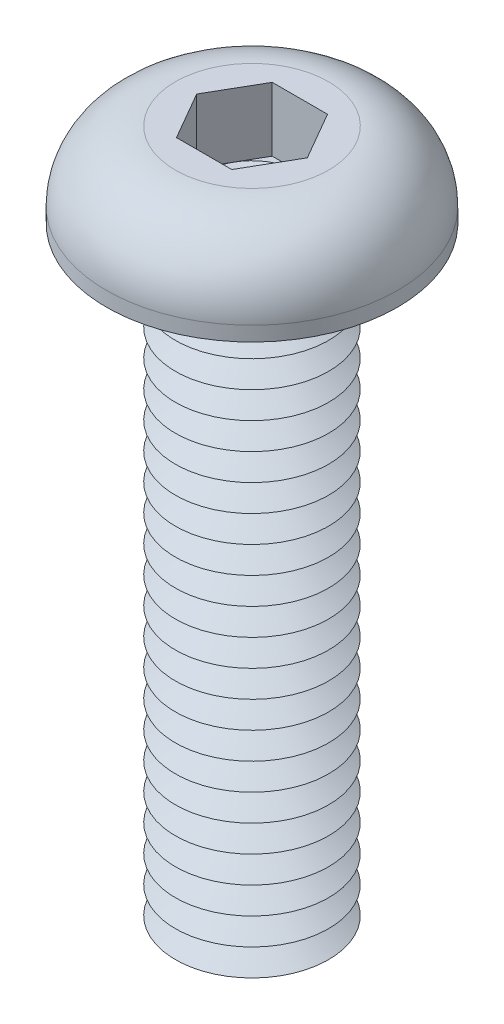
ISO-10303-21;
HEADER;
FILE_DESCRIPTION(('STEP AP214'),'2;1');
FILE_NAME('part.step','',(''),(''),'','','');
FILE_SCHEMA(('AUTOMOTIVE_DESIGN { 1 0 10303 214 1 1 1 1 }'));
ENDSEC;
DATA;
#1=APPLICATION_CONTEXT('core data for automotive mechanical design processes');
#2=APPLICATION_PROTOCOL_DEFINITION('international standard','automotive_design',2000,#1);
#3=PRODUCT_CONTEXT('',#1,'mechanical');
#4=PRODUCT('Part','Part','',(#3));
#5=PRODUCT_RELATED_PRODUCT_CATEGORY('part','',(#4));
#6=PRODUCT_DEFINITION_FORMATION('','',#4);
#7=PRODUCT_DEFINITION_CONTEXT('part definition',#1,'design');
#8=PRODUCT_DEFINITION('design','',#6,#7);
#9=PRODUCT_DEFINITION_SHAPE('','',#8);
#10=(LENGTH_UNIT() NAMED_UNIT(*) SI_UNIT(.MILLI.,.METRE.));
#11=(NAMED_UNIT(*) PLANE_ANGLE_UNIT() SI_UNIT($,.RADIAN.));
#12=(NAMED_UNIT(*) SI_UNIT($,.STERADIAN.) SOLID_ANGLE_UNIT());
#13=UNCERTAINTY_MEASURE_WITH_UNIT(LENGTH_MEASURE(1.E-05),#10,'distance_accuracy_value','');
#14=(GEOMETRIC_REPRESENTATION_CONTEXT(3) GLOBAL_UNCERTAINTY_ASSIGNED_CONTEXT((#13)) GLOBAL_UNIT_ASSIGNED_CONTEXT((#10,
#11,#12)) REPRESENTATION_CONTEXT('',''));
#15=CARTESIAN_POINT('',(0.,0.,0.));
#16=DIRECTION('',(0.,0.,1.));
#17=DIRECTION('',(1.,0.,0.));
#18=AXIS2_PLACEMENT_3D('',#15,#16,#17);
#19=CARTESIAN_POINT('',(0.,0.,0.));
#20=DIRECTION('',(0.,-1.,0.));
#21=DIRECTION('',(0.,0.,-1.));
#22=AXIS2_PLACEMENT_3D('',#19,#20,#21);
#23=TOROIDAL_SURFACE('',#22,2.35,0.35);
#24=CARTESIAN_POINT('',(0.,0.,-2.7));
#25=VERTEX_POINT('',#24);
#26=VERTEX_LOOP('',#25);
#27=FACE_BOUND('',#26,.T.);
#28=ADVANCED_FACE('P0_F12',(#27),#23,.T.);
#29=CLOSED_SHELL('',(#28));
#30=MANIFOLD_SOLID_BREP('P0_B1',#29);
#31=CARTESIAN_POINT('',(0.721687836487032,0.530000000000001,-1.25));
#32=DIRECTION('',(0.,1.,0.));
#33=DIRECTION('',(0.,0.,1.));
#34=AXIS2_PLACEMENT_3D('',#31,#32,#33);
#35=PLANE('',#34);
#36=CARTESIAN_POINT('',(0.,0.530000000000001,0.));
#37=DIRECTION('',(0.,1.,0.));
#38=DIRECTION('',(0.,0.,1.));
#39=AXIS2_PLACEMENT_3D('',#36,#37,#38);
#40=CIRCLE('',#39,1.25);
#41=CARTESIAN_POINT('',(0.,0.530000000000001,1.25));
#42=VERTEX_POINT('',#41);
#43=CARTESIAN_POINT('',(1.08253175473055,0.530000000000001,0.625));
#44=VERTEX_POINT('',#43);
#45=EDGE_CURVE('P1_E93',#42,#44,#40,.T.);
#46=ORIENTED_EDGE('',*,*,#45,.F.);
#47=DIRECTION('',(1.,0.,0.));
#48=VECTOR('',#47,1.);
#49=CARTESIAN_POINT('',(-0.721687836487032,0.530000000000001,1.25));
#50=LINE('',#49,#48);
#51=CARTESIAN_POINT('',(0.721687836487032,0.530000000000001,1.25));
#52=VERTEX_POINT('',#51);
#53=EDGE_CURVE('P1_E116',#42,#52,#50,.T.);
#54=ORIENTED_EDGE('',*,*,#53,.T.);
#55=DIRECTION('',(0.5,0.,-0.866025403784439));
#56=VECTOR('',#55,1.);
#57=CARTESIAN_POINT('',(0.721687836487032,0.530000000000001,1.25));
#58=LINE('',#57,#56);
#59=EDGE_CURVE('P1_E112',#52,#44,#58,.T.);
#60=ORIENTED_EDGE('',*,*,#59,.T.);
#61=EDGE_LOOP('',(#46,#54,#60));
#62=FACE_BOUND('',#61,.T.);
#63=ADVANCED_FACE('P1_F15',(#62),#35,.T.);
#64=CARTESIAN_POINT('',(0.,0.530000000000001,0.));
#65=DIRECTION('',(0.,1.,0.));
#66=DIRECTION('',(0.,0.,1.));
#67=AXIS2_PLACEMENT_3D('',#64,#65,#66);
#68=CIRCLE('',#67,1.25);
#69=CARTESIAN_POINT('',(1.08253175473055,0.530000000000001,-0.625));
#70=VERTEX_POINT('',#69);
#71=EDGE_CURVE('P1_E10',#44,#70,#68,.T.);
#72=ORIENTED_EDGE('',*,*,#71,.F.);
#73=CARTESIAN_POINT('',(1.44337567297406,0.530000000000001,0.));
#74=VERTEX_POINT('',#73);
#75=EDGE_CURVE('P1_E104',#44,#74,#58,.T.);
#76=ORIENTED_EDGE('',*,*,#75,.T.);
#77=DIRECTION('',(-0.5,0.,-0.866025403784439));
#78=VECTOR('',#77,1.);
#79=CARTESIAN_POINT('',(1.44337567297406,0.530000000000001,0.));
#80=LINE('',#79,#78);
#81=EDGE_CURVE('P1_E107',#74,#70,#80,.T.);
#82=ORIENTED_EDGE('',*,*,#81,.T.);
#83=EDGE_LOOP('',(#72,#76,#82));
#84=FACE_BOUND('',#83,.T.);
#85=ADVANCED_FACE('P1_F103',(#84),#35,.T.);
#86=CARTESIAN_POINT('',(0.,0.530000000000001,-1.25));
#87=VERTEX_POINT('',#86);
#88=EDGE_CURVE('P1_E24',#70,#87,#68,.T.);
#89=ORIENTED_EDGE('',*,*,#88,.F.);
#90=CARTESIAN_POINT('',(0.721687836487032,0.530000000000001,-1.25));
#91=VERTEX_POINT('',#90);
#92=EDGE_CURVE('P1_E139',#70,#91,#80,.T.);
#93=ORIENTED_EDGE('',*,*,#92,.T.);
#94=DIRECTION('',(-1.,0.,0.));
#95=VECTOR('',#94,1.);
#96=CARTESIAN_POINT('',(0.721687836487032,0.530000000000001,-1.25));
#97=LINE('',#96,#95);
#98=EDGE_CURVE('P1_E354',#91,#87,#97,.T.);
#99=ORIENTED_EDGE('',*,*,#98,.T.);
#100=EDGE_LOOP('',(#89,#93,#99));
#101=FACE_BOUND('',#100,.T.);
#102=ADVANCED_FACE('P1_F319',(#101),#35,.T.);
#103=CARTESIAN_POINT('',(-1.08253175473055,0.530000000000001,-0.625));
#104=VERTEX_POINT('',#103);
#105=EDGE_CURVE('P1_E349',#87,#104,#68,.T.);
#106=ORIENTED_EDGE('',*,*,#105,.F.);
#107=CARTESIAN_POINT('',(-0.721687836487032,0.530000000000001,-1.25));
#108=VERTEX_POINT('',#107);
#109=EDGE_CURVE('P1_E358',#87,#108,#97,.T.);
#110=ORIENTED_EDGE('',*,*,#109,.T.);
#111=DIRECTION('',(-0.5,0.,0.866025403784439));
#112=VECTOR('',#111,1.);
#113=CARTESIAN_POINT('',(-0.721687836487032,0.530000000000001,-1.25));
#114=LINE('',#113,#112);
#115=EDGE_CURVE('P1_E353',#108,#104,#114,.T.);
#116=ORIENTED_EDGE('',*,*,#115,.T.);
#117=EDGE_LOOP('',(#106,#110,#116));
#118=FACE_BOUND('',#117,.T.);
#119=ADVANCED_FACE('P1_F333',(#118),#35,.T.);
#120=CARTESIAN_POINT('',(-1.08253175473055,0.530000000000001,0.625));
#121=VERTEX_POINT('',#120);
#122=EDGE_CURVE('P1_E31',#104,#121,#68,.T.);
#123=ORIENTED_EDGE('',*,*,#122,.F.);
#124=CARTESIAN_POINT('',(-1.44337567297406,0.530000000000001,0.));
#125=VERTEX_POINT('',#124);
#126=EDGE_CURVE('P1_E345',#104,#125,#114,.T.);
#127=ORIENTED_EDGE('',*,*,#126,.T.);
#128=DIRECTION('',(0.5,0.,0.866025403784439));
#129=VECTOR('',#128,1.);
#130=CARTESIAN_POINT('',(-1.44337567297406,0.530000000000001,0.));
#131=LINE('',#130,#129);
#132=EDGE_CURVE('P1_E348',#125,#121,#131,.T.);
#133=ORIENTED_EDGE('',*,*,#132,.T.);
#134=EDGE_LOOP('',(#123,#127,#133));
#135=FACE_BOUND('',#134,.T.);
#136=ADVANCED_FACE('P1_F324',(#135),#35,.T.);
#137=CARTESIAN_POINT('',(0.,-15.3,0.));
#138=DIRECTION('',(0.,1.,0.));
#139=DIRECTION('',(0.,0.,1.));
#140=AXIS2_PLACEMENT_3D('',#137,#138,#139);
#141=CONICAL_SURFACE('',#140,1.39378221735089,1.0471975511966);
#142=CARTESIAN_POINT('',(0.,-14.95,0.));
#143=DIRECTION('',(0.,-1.,0.));
#144=DIRECTION('',(0.,0.,-1.));
#145=AXIS2_PLACEMENT_3D('',#142,#143,#144);
#146=CIRCLE('',#145,2.);
#147=CARTESIAN_POINT('',(0.,-14.95,-2.));
#148=VERTEX_POINT('',#147);
#149=EDGE_CURVE('P1_E281',#148,#148,#146,.T.);
#150=ORIENTED_EDGE('',*,*,#149,.T.);
#151=EDGE_LOOP('',(#150));
#152=FACE_BOUND('',#151,.T.);
#153=CARTESIAN_POINT('',(0.,-15.3,0.));
#154=DIRECTION('',(0.,-1.,0.));
#155=DIRECTION('',(0.,0.,-1.));
#156=AXIS2_PLACEMENT_3D('',#153,#154,#155);
#157=CIRCLE('',#156,1.39378221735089);
#158=CARTESIAN_POINT('',(0.,-15.3,-1.39378221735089));
#159=VERTEX_POINT('',#158);
#160=EDGE_CURVE('P1_E284',#159,#159,#157,.T.);
#161=ORIENTED_EDGE('',*,*,#160,.F.);
#162=EDGE_LOOP('',(#161));
#163=FACE_BOUND('',#162,.T.);
#164=ADVANCED_FACE('P1_F332',(#152,#163),#141,.T.);
#165=CARTESIAN_POINT('',(0.,-15.65,0.));
#166=DIRECTION('',(0.,-1.,0.));
#167=DIRECTION('',(0.,0.,-1.));
#168=AXIS2_PLACEMENT_3D('',#165,#166,#167);
#169=CONICAL_SURFACE('',#168,2.,1.0471975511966);
#170=ORIENTED_EDGE('',*,*,#160,.T.);
#171=EDGE_LOOP('',(#170));
#172=FACE_BOUND('',#171,.T.);
#173=CARTESIAN_POINT('',(0.,-15.65,0.));
#174=DIRECTION('',(0.,-1.,0.));
#175=DIRECTION('',(0.,0.,-1.));
#176=AXIS2_PLACEMENT_3D('',#173,#174,#175);
#177=CIRCLE('',#176,2.);
#178=CARTESIAN_POINT('',(0.,-15.65,-2.));
#179=VERTEX_POINT('',#178);
#180=EDGE_CURVE('P1_E287',#179,#179,#177,.T.);
#181=ORIENTED_EDGE('',*,*,#180,.F.);
#182=EDGE_LOOP('',(#181));
#183=FACE_BOUND('',#182,.T.);
#184=ADVANCED_FACE('P1_F339',(#172,#183),#169,.T.);
#185=CARTESIAN_POINT('',(0.,-16.,0.));
#186=DIRECTION('',(0.,1.,0.));
#187=DIRECTION('',(0.,0.,1.));
#188=AXIS2_PLACEMENT_3D('',#185,#186,#187);
#189=PLANE('',#188);
#190=CARTESIAN_POINT('',(0.,-16.,0.));
#191=DIRECTION('',(0.,-1.,0.));
#192=DIRECTION('',(0.,0.,-1.));
#193=AXIS2_PLACEMENT_3D('',#190,#191,#192);
#194=CIRCLE('',#193,1.39378221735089);
#195=CARTESIAN_POINT('',(0.,-16.,-1.39378221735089));
#196=VERTEX_POINT('',#195);
#197=EDGE_CURVE('P1_E290',#196,#196,#194,.T.);
#198=ORIENTED_EDGE('',*,*,#197,.T.);
#199=EDGE_LOOP('',(#198));
#200=FACE_BOUND('',#199,.T.);
#201=ADVANCED_FACE('P1_F417',(#200),#189,.F.);
#202=CARTESIAN_POINT('',(0.,-16.,0.));
#203=DIRECTION('',(0.,1.,0.));
#204=DIRECTION('',(0.,0.,1.));
#205=AXIS2_PLACEMENT_3D('',#202,#203,#204);
#206=CONICAL_SURFACE('',#205,1.39378221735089,1.0471975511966);
#207=ORIENTED_EDGE('',*,*,#180,.T.);
#208=EDGE_LOOP('',(#207));
#209=FACE_BOUND('',#208,.T.);
#210=ORIENTED_EDGE('',*,*,#197,.F.);
#211=EDGE_LOOP('',(#210));
#212=FACE_BOUND('',#211,.T.);
#213=ADVANCED_FACE('P1_F428',(#209,#212),#206,.T.);
#214=CARTESIAN_POINT('',(0.,-14.6,0.));
#215=DIRECTION('',(0.,1.,0.));
#216=DIRECTION('',(0.,0.,1.));
#217=AXIS2_PLACEMENT_3D('',#214,#215,#216);
#218=CONICAL_SURFACE('',#217,1.39378221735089,1.0471975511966);
#219=CARTESIAN_POINT('',(0.,-14.25,0.));
#220=DIRECTION('',(0.,-1.,0.));
#221=DIRECTION('',(0.,0.,-1.));
#222=AXIS2_PLACEMENT_3D('',#219,#220,#221);
#223=CIRCLE('',#222,2.);
#224=CARTESIAN_POINT('',(0.,-14.25,-2.));
#225=VERTEX_POINT('',#224);
#226=EDGE_CURVE('P1_E275',#225,#225,#223,.T.);
#227=ORIENTED_EDGE('',*,*,#226,.T.);
#228=EDGE_LOOP('',(#227));
#229=FACE_BOUND('',#228,.T.);
#230=CARTESIAN_POINT('',(0.,-14.6,0.));
#231=DIRECTION('',(0.,-1.,0.));
#232=DIRECTION('',(0.,0.,-1.));
#233=AXIS2_PLACEMENT_3D('',#230,#231,#232);
#234=CIRCLE('',#233,1.39378221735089);
#235=CARTESIAN_POINT('',(0.,-14.6,-1.39378221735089));
#236=VERTEX_POINT('',#235);
#237=EDGE_CURVE('P1_E278',#236,#236,#234,.T.);
#238=ORIENTED_EDGE('',*,*,#237,.F.);
#239=EDGE_LOOP('',(#238));
#240=FACE_BOUND('',#239,.T.);
#241=ADVANCED_FACE('P1_F437',(#229,#240),#218,.T.);
#242=CARTESIAN_POINT('',(0.,-14.95,0.));
#243=DIRECTION('',(0.,-1.,0.));
#244=DIRECTION('',(0.,0.,-1.));
#245=AXIS2_PLACEMENT_3D('',#242,#243,#244);
#246=CONICAL_SURFACE('',#245,2.,1.0471975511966);
#247=ORIENTED_EDGE('',*,*,#237,.T.);
#248=EDGE_LOOP('',(#247));
#249=FACE_BOUND('',#248,.T.);
#250=ORIENTED_EDGE('',*,*,#149,.F.);
#251=EDGE_LOOP('',(#250));
#252=FACE_BOUND('',#251,.T.);
#253=ADVANCED_FACE('P1_F446',(#249,#252),#246,.T.);
#254=CARTESIAN_POINT('',(0.,-13.9,0.));
#255=DIRECTION('',(0.,1.,0.));
#256=DIRECTION('',(0.,0.,1.));
#257=AXIS2_PLACEMENT_3D('',#254,#255,#256);
#258=CONICAL_SURFACE('',#257,1.39378221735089,1.0471975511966);
#259=CARTESIAN_POINT('',(0.,-13.55,0.));
#260=DIRECTION('',(0.,-1.,0.));
#261=DIRECTION('',(0.,0.,-1.));
#262=AXIS2_PLACEMENT_3D('',#259,#260,#261);
#263=CIRCLE('',#262,2.);
#264=CARTESIAN_POINT('',(0.,-13.55,-2.));
#265=VERTEX_POINT('',#264);
#266=EDGE_CURVE('P1_E269',#265,#265,#263,.T.);
#267=ORIENTED_EDGE('',*,*,#266,.T.);
#268=EDGE_LOOP('',(#267));
#269=FACE_BOUND('',#268,.T.);
#270=CARTESIAN_POINT('',(0.,-13.9,0.));
#271=DIRECTION('',(0.,-1.,0.));
#272=DIRECTION('',(0.,0.,-1.));
#273=AXIS2_PLACEMENT_3D('',#270,#271,#272);
#274=CIRCLE('',#273,1.39378221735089);
#275=CARTESIAN_POINT('',(0.,-13.9,-1.39378221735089));
#276=VERTEX_POINT('',#275);
#277=EDGE_CURVE('P1_E272',#276,#276,#274,.T.);
#278=ORIENTED_EDGE('',*,*,#277,.F.);
#279=EDGE_LOOP('',(#278));
#280=FACE_BOUND('',#279,.T.);
#281=ADVANCED_FACE('P1_F456',(#269,#280),#258,.T.);
#282=CARTESIAN_POINT('',(0.,-14.25,0.));
#283=DIRECTION('',(0.,-1.,0.));
#284=DIRECTION('',(0.,0.,-1.));
#285=AXIS2_PLACEMENT_3D('',#282,#283,#284);
#286=CONICAL_SURFACE('',#285,2.,1.0471975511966);
#287=ORIENTED_EDGE('',*,*,#277,.T.);
#288=EDGE_LOOP('',(#287));
#289=FACE_BOUND('',#288,.T.);
#290=ORIENTED_EDGE('',*,*,#226,.F.);
#291=EDGE_LOOP('',(#290));
#292=FACE_BOUND('',#291,.T.);
#293=ADVANCED_FACE('P1_F466',(#289,#292),#286,.T.);
#294=CARTESIAN_POINT('',(0.,-13.2,0.));
#295=DIRECTION('',(0.,1.,0.));
#296=DIRECTION('',(0.,0.,1.));
#297=AXIS2_PLACEMENT_3D('',#294,#295,#296);
#298=CONICAL_SURFACE('',#297,1.39378221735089,1.0471975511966);
#299=CARTESIAN_POINT('',(0.,-12.85,0.));
#300=DIRECTION('',(0.,-1.,0.));
#301=DIRECTION('',(0.,0.,-1.));
#302=AXIS2_PLACEMENT_3D('',#299,#300,#301);
#303=CIRCLE('',#302,2.);
#304=CARTESIAN_POINT('',(0.,-12.85,-2.));
#305=VERTEX_POINT('',#304);
#306=EDGE_CURVE('P1_E263',#305,#305,#303,.T.);
#307=ORIENTED_EDGE('',*,*,#306,.T.);
#308=EDGE_LOOP('',(#307));
#309=FACE_BOUND('',#308,.T.);
#310=CARTESIAN_POINT('',(0.,-13.2,0.));
#311=DIRECTION('',(0.,-1.,0.));
#312=DIRECTION('',(0.,0.,-1.));
#313=AXIS2_PLACEMENT_3D('',#310,#311,#312);
#314=CIRCLE('',#313,1.39378221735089);
#315=CARTESIAN_POINT('',(0.,-13.2,-1.39378221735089));
#316=VERTEX_POINT('',#315);
#317=EDGE_CURVE('P1_E266',#316,#316,#314,.T.);
#318=ORIENTED_EDGE('',*,*,#317,.F.);
#319=EDGE_LOOP('',(#318));
#320=FACE_BOUND('',#319,.T.);
#321=ADVANCED_FACE('P1_F476',(#309,#320),#298,.T.);
#322=CARTESIAN_POINT('',(0.,-13.55,0.));
#323=DIRECTION('',(0.,-1.,0.));
#324=DIRECTION('',(0.,0.,-1.));
#325=AXIS2_PLACEMENT_3D('',#322,#323,#324);
#326=CONICAL_SURFACE('',#325,2.,1.0471975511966);
#327=ORIENTED_EDGE('',*,*,#317,.T.);
#328=EDGE_LOOP('',(#327));
#329=FACE_BOUND('',#328,.T.);
#330=ORIENTED_EDGE('',*,*,#266,.F.);
#331=EDGE_LOOP('',(#330));
#332=FACE_BOUND('',#331,.T.);
#333=ADVANCED_FACE('P1_F486',(#329,#332),#326,.T.);
#334=CARTESIAN_POINT('',(0.,-12.5,0.));
#335=DIRECTION('',(0.,1.,0.));
#336=DIRECTION('',(0.,0.,1.));
#337=AXIS2_PLACEMENT_3D('',#334,#335,#336);
#338=CONICAL_SURFACE('',#337,1.39378221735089,1.0471975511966);
#339=CARTESIAN_POINT('',(0.,-12.15,0.));
#340=DIRECTION('',(0.,-1.,0.));
#341=DIRECTION('',(0.,0.,-1.));
#342=AXIS2_PLACEMENT_3D('',#339,#340,#341);
#343=CIRCLE('',#342,2.);
#344=CARTESIAN_POINT('',(0.,-12.15,-2.));
#345=VERTEX_POINT('',#344);
#346=EDGE_CURVE('P1_E257',#345,#345,#343,.T.);
#347=ORIENTED_EDGE('',*,*,#346,.T.);
#348=EDGE_LOOP('',(#347));
#349=FACE_BOUND('',#348,.T.);
#350=CARTESIAN_POINT('',(0.,-12.5,0.));
#351=DIRECTION('',(0.,-1.,0.));
#352=DIRECTION('',(0.,0.,-1.));
#353=AXIS2_PLACEMENT_3D('',#350,#351,#352);
#354=CIRCLE('',#353,1.39378221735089);
#355=CARTESIAN_POINT('',(0.,-12.5,-1.39378221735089));
#356=VERTEX_POINT('',#355);
#357=EDGE_CURVE('P1_E260',#356,#356,#354,.T.);
#358=ORIENTED_EDGE('',*,*,#357,.F.);
#359=EDGE_LOOP('',(#358));
#360=FACE_BOUND('',#359,.T.);
#361=ADVANCED_FACE('P1_F496',(#349,#360),#338,.T.);
#362=CARTESIAN_POINT('',(0.,-12.85,0.));
#363=DIRECTION('',(0.,-1.,0.));
#364=DIRECTION('',(0.,0.,-1.));
#365=AXIS2_PLACEMENT_3D('',#362,#363,#364);
#366=CONICAL_SURFACE('',#365,2.,1.0471975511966);
#367=ORIENTED_EDGE('',*,*,#357,.T.);
#368=EDGE_LOOP('',(#367));
#369=FACE_BOUND('',#368,.T.);
#370=ORIENTED_EDGE('',*,*,#306,.F.);
#371=EDGE_LOOP('',(#370));
#372=FACE_BOUND('',#371,.T.);
#373=ADVANCED_FACE('P1_F506',(#369,#372),#366,.T.);
#374=CARTESIAN_POINT('',(0.,-11.8,0.));
#375=DIRECTION('',(0.,1.,0.));
#376=DIRECTION('',(0.,0.,1.));
#377=AXIS2_PLACEMENT_3D('',#374,#375,#376);
#378=CONICAL_SURFACE('',#377,1.39378221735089,1.0471975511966);
#379=CARTESIAN_POINT('',(0.,-11.45,0.));
#380=DIRECTION('',(0.,-1.,0.));
#381=DIRECTION('',(0.,0.,-1.));
#382=AXIS2_PLACEMENT_3D('',#379,#380,#381);
#383=CIRCLE('',#382,2.);
#384=CARTESIAN_POINT('',(0.,-11.45,-2.));
#385=VERTEX_POINT('',#384);
#386=EDGE_CURVE('P1_E251',#385,#385,#383,.T.);
#387=ORIENTED_EDGE('',*,*,#386,.T.);
#388=EDGE_LOOP('',(#387));
#389=FACE_BOUND('',#388,.T.);
#390=CARTESIAN_POINT('',(0.,-11.8,0.));
#391=DIRECTION('',(0.,-1.,0.));
#392=DIRECTION('',(0.,0.,-1.));
#393=AXIS2_PLACEMENT_3D('',#390,#391,#392);
#394=CIRCLE('',#393,1.39378221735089);
#395=CARTESIAN_POINT('',(0.,-11.8,-1.39378221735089));
#396=VERTEX_POINT('',#395);
#397=EDGE_CURVE('P1_E254',#396,#396,#394,.T.);
#398=ORIENTED_EDGE('',*,*,#397,.F.);
#399=EDGE_LOOP('',(#398));
#400=FACE_BOUND('',#399,.T.);
#401=ADVANCED_FACE('P1_F516',(#389,#400),#378,.T.);
#402=CARTESIAN_POINT('',(0.,-12.15,0.));
#403=DIRECTION('',(0.,-1.,0.));
#404=DIRECTION('',(0.,0.,-1.));
#405=AXIS2_PLACEMENT_3D('',#402,#403,#404);
#406=CONICAL_SURFACE('',#405,2.,1.0471975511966);
#407=ORIENTED_EDGE('',*,*,#397,.T.);
#408=EDGE_LOOP('',(#407));
#409=FACE_BOUND('',#408,.T.);
#410=ORIENTED_EDGE('',*,*,#346,.F.);
#411=EDGE_LOOP('',(#410));
#412=FACE_BOUND('',#411,.T.);
#413=ADVANCED_FACE('P1_F526',(#409,#412),#406,.T.);
#414=CARTESIAN_POINT('',(0.,-11.1,0.));
#415=DIRECTION('',(0.,1.,0.));
#416=DIRECTION('',(0.,0.,1.));
#417=AXIS2_PLACEMENT_3D('',#414,#415,#416);
#418=CONICAL_SURFACE('',#417,1.39378221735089,1.0471975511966);
#419=CARTESIAN_POINT('',(0.,-10.75,0.));
#420=DIRECTION('',(0.,-1.,0.));
#421=DIRECTION('',(0.,0.,-1.));
#422=AXIS2_PLACEMENT_3D('',#419,#420,#421);
#423=CIRCLE('',#422,2.);
#424=CARTESIAN_POINT('',(0.,-10.75,-2.));
#425=VERTEX_POINT('',#424);
#426=EDGE_CURVE('P1_E245',#425,#425,#423,.T.);
#427=ORIENTED_EDGE('',*,*,#426,.T.);
#428=EDGE_LOOP('',(#427));
#429=FACE_BOUND('',#428,.T.);
#430=CARTESIAN_POINT('',(0.,-11.1,0.));
#431=DIRECTION('',(0.,-1.,0.));
#432=DIRECTION('',(0.,0.,-1.));
#433=AXIS2_PLACEMENT_3D('',#430,#431,#432);
#434=CIRCLE('',#433,1.39378221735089);
#435=CARTESIAN_POINT('',(0.,-11.1,-1.39378221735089));
#436=VERTEX_POINT('',#435);
#437=EDGE_CURVE('P1_E248',#436,#436,#434,.T.);
#438=ORIENTED_EDGE('',*,*,#437,.F.);
#439=EDGE_LOOP('',(#438));
#440=FACE_BOUND('',#439,.T.);
#441=ADVANCED_FACE('P1_F536',(#429,#440),#418,.T.);
#442=CARTESIAN_POINT('',(0.,-11.45,0.));
#443=DIRECTION('',(0.,-1.,0.));
#444=DIRECTION('',(0.,0.,-1.));
#445=AXIS2_PLACEMENT_3D('',#442,#443,#444);
#446=CONICAL_SURFACE('',#445,2.,1.0471975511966);
#447=ORIENTED_EDGE('',*,*,#437,.T.);
#448=EDGE_LOOP('',(#447));
#449=FACE_BOUND('',#448,.T.);
#450=ORIENTED_EDGE('',*,*,#386,.F.);
#451=EDGE_LOOP('',(#450));
#452=FACE_BOUND('',#451,.T.);
#453=ADVANCED_FACE('P1_F546',(#449,#452),#446,.T.);
#454=CARTESIAN_POINT('',(0.,-10.4,0.));
#455=DIRECTION('',(0.,1.,0.));
#456=DIRECTION('',(0.,0.,1.));
#457=AXIS2_PLACEMENT_3D('',#454,#455,#456);
#458=CONICAL_SURFACE('',#457,1.39378221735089,1.0471975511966);
#459=CARTESIAN_POINT('',(0.,-10.05,0.));
#460=DIRECTION('',(0.,-1.,0.));
#461=DIRECTION('',(0.,0.,-1.));
#462=AXIS2_PLACEMENT_3D('',#459,#460,#461);
#463=CIRCLE('',#462,2.);
#464=CARTESIAN_POINT('',(0.,-10.05,-2.));
#465=VERTEX_POINT('',#464);
#466=EDGE_CURVE('P1_E239',#465,#465,#463,.T.);
#467=ORIENTED_EDGE('',*,*,#466,.T.);
#468=EDGE_LOOP('',(#467));
#469=FACE_BOUND('',#468,.T.);
#470=CARTESIAN_POINT('',(0.,-10.4,0.));
#471=DIRECTION('',(0.,-1.,0.));
#472=DIRECTION('',(0.,0.,-1.));
#473=AXIS2_PLACEMENT_3D('',#470,#471,#472);
#474=CIRCLE('',#473,1.39378221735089);
#475=CARTESIAN_POINT('',(0.,-10.4,-1.39378221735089));
#476=VERTEX_POINT('',#475);
#477=EDGE_CURVE('P1_E242',#476,#476,#474,.T.);
#478=ORIENTED_EDGE('',*,*,#477,.F.);
#479=EDGE_LOOP('',(#478));
#480=FACE_BOUND('',#479,.T.);
#481=ADVANCED_FACE('P1_F556',(#469,#480),#458,.T.);
#482=CARTESIAN_POINT('',(0.,-10.75,0.));
#483=DIRECTION('',(0.,-1.,0.));
#484=DIRECTION('',(0.,0.,-1.));
#485=AXIS2_PLACEMENT_3D('',#482,#483,#484);
#486=CONICAL_SURFACE('',#485,2.,1.0471975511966);
#487=ORIENTED_EDGE('',*,*,#477,.T.);
#488=EDGE_LOOP('',(#487));
#489=FACE_BOUND('',#488,.T.);
#490=ORIENTED_EDGE('',*,*,#426,.F.);
#491=EDGE_LOOP('',(#490));
#492=FACE_BOUND('',#491,.T.);
#493=ADVANCED_FACE('P1_F566',(#489,#492),#486,.T.);
#494=CARTESIAN_POINT('',(0.,-9.7,0.));
#495=DIRECTION('',(0.,1.,0.));
#496=DIRECTION('',(0.,0.,1.));
#497=AXIS2_PLACEMENT_3D('',#494,#495,#496);
#498=CONICAL_SURFACE('',#497,1.39378221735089,1.0471975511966);
#499=CARTESIAN_POINT('',(0.,-9.35,0.));
#500=DIRECTION('',(0.,-1.,0.));
#501=DIRECTION('',(0.,0.,-1.));
#502=AXIS2_PLACEMENT_3D('',#499,#500,#501);
#503=CIRCLE('',#502,2.);
#504=CARTESIAN_POINT('',(0.,-9.35,-2.));
#505=VERTEX_POINT('',#504);
#506=EDGE_CURVE('P1_E233',#505,#505,#503,.T.);
#507=ORIENTED_EDGE('',*,*,#506,.T.);
#508=EDGE_LOOP('',(#507));
#509=FACE_BOUND('',#508,.T.);
#510=CARTESIAN_POINT('',(0.,-9.7,0.));
#511=DIRECTION('',(0.,-1.,0.));
#512=DIRECTION('',(0.,0.,-1.));
#513=AXIS2_PLACEMENT_3D('',#510,#511,#512);
#514=CIRCLE('',#513,1.39378221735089);
#515=CARTESIAN_POINT('',(0.,-9.7,-1.39378221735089));
#516=VERTEX_POINT('',#515);
#517=EDGE_CURVE('P1_E236',#516,#516,#514,.T.);
#518=ORIENTED_EDGE('',*,*,#517,.F.);
#519=EDGE_LOOP('',(#518));
#520=FACE_BOUND('',#519,.T.);
#521=ADVANCED_FACE('P1_F576',(#509,#520),#498,.T.);
#522=CARTESIAN_POINT('',(0.,-10.05,0.));
#523=DIRECTION('',(0.,-1.,0.));
#524=DIRECTION('',(0.,0.,-1.));
#525=AXIS2_PLACEMENT_3D('',#522,#523,#524);
#526=CONICAL_SURFACE('',#525,2.,1.0471975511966);
#527=ORIENTED_EDGE('',*,*,#517,.T.);
#528=EDGE_LOOP('',(#527));
#529=FACE_BOUND('',#528,.T.);
#530=ORIENTED_EDGE('',*,*,#466,.F.);
#531=EDGE_LOOP('',(#530));
#532=FACE_BOUND('',#531,.T.);
#533=ADVANCED_FACE('P1_F586',(#529,#532),#526,.T.);
#534=CARTESIAN_POINT('',(0.,-9.,0.));
#535=DIRECTION('',(0.,1.,0.));
#536=DIRECTION('',(0.,0.,1.));
#537=AXIS2_PLACEMENT_3D('',#534,#535,#536);
#538=CONICAL_SURFACE('',#537,1.39378221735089,1.0471975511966);
#539=CARTESIAN_POINT('',(0.,-8.65,0.));
#540=DIRECTION('',(0.,-1.,0.));
#541=DIRECTION('',(0.,0.,-1.));
#542=AXIS2_PLACEMENT_3D('',#539,#540,#541);
#543=CIRCLE('',#542,2.);
#544=CARTESIAN_POINT('',(0.,-8.65,-2.));
#545=VERTEX_POINT('',#544);
#546=EDGE_CURVE('P1_E227',#545,#545,#543,.T.);
#547=ORIENTED_EDGE('',*,*,#546,.T.);
#548=EDGE_LOOP('',(#547));
#549=FACE_BOUND('',#548,.T.);
#550=CARTESIAN_POINT('',(0.,-9.,0.));
#551=DIRECTION('',(0.,-1.,0.));
#552=DIRECTION('',(0.,0.,-1.));
#553=AXIS2_PLACEMENT_3D('',#550,#551,#552);
#554=CIRCLE('',#553,1.39378221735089);
#555=CARTESIAN_POINT('',(0.,-9.,-1.39378221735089));
#556=VERTEX_POINT('',#555);
#557=EDGE_CURVE('P1_E230',#556,#556,#554,.T.);
#558=ORIENTED_EDGE('',*,*,#557,.F.);
#559=EDGE_LOOP('',(#558));
#560=FACE_BOUND('',#559,.T.);
#561=ADVANCED_FACE('P1_F596',(#549,#560),#538,.T.);
#562=CARTESIAN_POINT('',(0.,-9.35,0.));
#563=DIRECTION('',(0.,-1.,0.));
#564=DIRECTION('',(0.,0.,-1.));
#565=AXIS2_PLACEMENT_3D('',#562,#563,#564);
#566=CONICAL_SURFACE('',#565,2.,1.0471975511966);
#567=ORIENTED_EDGE('',*,*,#557,.T.);
#568=EDGE_LOOP('',(#567));
#569=FACE_BOUND('',#568,.T.);
#570=ORIENTED_EDGE('',*,*,#506,.F.);
#571=EDGE_LOOP('',(#570));
#572=FACE_BOUND('',#571,.T.);
#573=ADVANCED_FACE('P1_F606',(#569,#572),#566,.T.);
#574=CARTESIAN_POINT('',(0.,-8.3,0.));
#575=DIRECTION('',(0.,1.,0.));
#576=DIRECTION('',(0.,0.,1.));
#577=AXIS2_PLACEMENT_3D('',#574,#575,#576);
#578=CONICAL_SURFACE('',#577,1.39378221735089,1.0471975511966);
#579=CARTESIAN_POINT('',(0.,-7.95,0.));
#580=DIRECTION('',(0.,-1.,0.));
#581=DIRECTION('',(0.,0.,-1.));
#582=AXIS2_PLACEMENT_3D('',#579,#580,#581);
#583=CIRCLE('',#582,2.);
#584=CARTESIAN_POINT('',(0.,-7.95,-2.));
#585=VERTEX_POINT('',#584);
#586=EDGE_CURVE('P1_E221',#585,#585,#583,.T.);
#587=ORIENTED_EDGE('',*,*,#586,.T.);
#588=EDGE_LOOP('',(#587));
#589=FACE_BOUND('',#588,.T.);
#590=CARTESIAN_POINT('',(0.,-8.3,0.));
#591=DIRECTION('',(0.,-1.,0.));
#592=DIRECTION('',(0.,0.,-1.));
#593=AXIS2_PLACEMENT_3D('',#590,#591,#592);
#594=CIRCLE('',#593,1.39378221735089);
#595=CARTESIAN_POINT('',(0.,-8.3,-1.39378221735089));
#596=VERTEX_POINT('',#595);
#597=EDGE_CURVE('P1_E224',#596,#596,#594,.T.);
#598=ORIENTED_EDGE('',*,*,#597,.F.);
#599=EDGE_LOOP('',(#598));
#600=FACE_BOUND('',#599,.T.);
#601=ADVANCED_FACE('P1_F616',(#589,#600),#578,.T.);
#602=CARTESIAN_POINT('',(0.,-8.65,0.));
#603=DIRECTION('',(0.,-1.,0.));
#604=DIRECTION('',(0.,0.,-1.));
#605=AXIS2_PLACEMENT_3D('',#602,#603,#604);
#606=CONICAL_SURFACE('',#605,2.,1.0471975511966);
#607=ORIENTED_EDGE('',*,*,#597,.T.);
#608=EDGE_LOOP('',(#607));
#609=FACE_BOUND('',#608,.T.);
#610=ORIENTED_EDGE('',*,*,#546,.F.);
#611=EDGE_LOOP('',(#610));
#612=FACE_BOUND('',#611,.T.);
#613=ADVANCED_FACE('P1_F626',(#609,#612),#606,.T.);
#614=CARTESIAN_POINT('',(0.,-7.6,0.));
#615=DIRECTION('',(0.,1.,0.));
#616=DIRECTION('',(0.,0.,1.));
#617=AXIS2_PLACEMENT_3D('',#614,#615,#616);
#618=CONICAL_SURFACE('',#617,1.39378221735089,1.0471975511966);
#619=CARTESIAN_POINT('',(0.,-7.25,0.));
#620=DIRECTION('',(0.,-1.,0.));
#621=DIRECTION('',(0.,0.,-1.));
#622=AXIS2_PLACEMENT_3D('',#619,#620,#621);
#623=CIRCLE('',#622,2.);
#624=CARTESIAN_POINT('',(0.,-7.25,-2.));
#625=VERTEX_POINT('',#624);
#626=EDGE_CURVE('P1_E215',#625,#625,#623,.T.);
#627=ORIENTED_EDGE('',*,*,#626,.T.);
#628=EDGE_LOOP('',(#627));
#629=FACE_BOUND('',#628,.T.);
#630=CARTESIAN_POINT('',(0.,-7.6,0.));
#631=DIRECTION('',(0.,-1.,0.));
#632=DIRECTION('',(0.,0.,-1.));
#633=AXIS2_PLACEMENT_3D('',#630,#631,#632);
#634=CIRCLE('',#633,1.39378221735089);
#635=CARTESIAN_POINT('',(0.,-7.6,-1.39378221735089));
#636=VERTEX_POINT('',#635);
#637=EDGE_CURVE('P1_E218',#636,#636,#634,.T.);
#638=ORIENTED_EDGE('',*,*,#637,.F.);
#639=EDGE_LOOP('',(#638));
#640=FACE_BOUND('',#639,.T.);
#641=ADVANCED_FACE('P1_F636',(#629,#640),#618,.T.);
#642=CARTESIAN_POINT('',(0.,-7.95,0.));
#643=DIRECTION('',(0.,-1.,0.));
#644=DIRECTION('',(0.,0.,-1.));
#645=AXIS2_PLACEMENT_3D('',#642,#643,#644);
#646=CONICAL_SURFACE('',#645,2.,1.0471975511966);
#647=ORIENTED_EDGE('',*,*,#637,.T.);
#648=EDGE_LOOP('',(#647));
#649=FACE_BOUND('',#648,.T.);
#650=ORIENTED_EDGE('',*,*,#586,.F.);
#651=EDGE_LOOP('',(#650));
#652=FACE_BOUND('',#651,.T.);
#653=ADVANCED_FACE('P1_F646',(#649,#652),#646,.T.);
#654=CARTESIAN_POINT('',(0.,-6.9,0.));
#655=DIRECTION('',(0.,1.,0.));
#656=DIRECTION('',(0.,0.,1.));
#657=AXIS2_PLACEMENT_3D('',#654,#655,#656);
#658=CONICAL_SURFACE('',#657,1.39378221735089,1.0471975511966);
#659=CARTESIAN_POINT('',(0.,-6.55,0.));
#660=DIRECTION('',(0.,-1.,0.));
#661=DIRECTION('',(0.,0.,-1.));
#662=AXIS2_PLACEMENT_3D('',#659,#660,#661);
#663=CIRCLE('',#662,2.);
#664=CARTESIAN_POINT('',(0.,-6.55,-2.));
#665=VERTEX_POINT('',#664);
#666=EDGE_CURVE('P1_E209',#665,#665,#663,.T.);
#667=ORIENTED_EDGE('',*,*,#666,.T.);
#668=EDGE_LOOP('',(#667));
#669=FACE_BOUND('',#668,.T.);
#670=CARTESIAN_POINT('',(0.,-6.9,0.));
#671=DIRECTION('',(0.,-1.,0.));
#672=DIRECTION('',(0.,0.,-1.));
#673=AXIS2_PLACEMENT_3D('',#670,#671,#672);
#674=CIRCLE('',#673,1.39378221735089);
#675=CARTESIAN_POINT('',(0.,-6.9,-1.39378221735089));
#676=VERTEX_POINT('',#675);
#677=EDGE_CURVE('P1_E212',#676,#676,#674,.T.);
#678=ORIENTED_EDGE('',*,*,#677,.F.);
#679=EDGE_LOOP('',(#678));
#680=FACE_BOUND('',#679,.T.);
#681=ADVANCED_FACE('P1_F656',(#669,#680),#658,.T.);
#682=CARTESIAN_POINT('',(0.,-7.25,0.));
#683=DIRECTION('',(0.,-1.,0.));
#684=DIRECTION('',(0.,0.,-1.));
#685=AXIS2_PLACEMENT_3D('',#682,#683,#684);
#686=CONICAL_SURFACE('',#685,2.,1.0471975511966);
#687=ORIENTED_EDGE('',*,*,#677,.T.);
#688=EDGE_LOOP('',(#687));
#689=FACE_BOUND('',#688,.T.);
#690=ORIENTED_EDGE('',*,*,#626,.F.);
#691=EDGE_LOOP('',(#690));
#692=FACE_BOUND('',#691,.T.);
#693=ADVANCED_FACE('P1_F666',(#689,#692),#686,.T.);
#694=CARTESIAN_POINT('',(0.,-6.2,0.));
#695=DIRECTION('',(0.,1.,0.));
#696=DIRECTION('',(0.,0.,1.));
#697=AXIS2_PLACEMENT_3D('',#694,#695,#696);
#698=CONICAL_SURFACE('',#697,1.39378221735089,1.0471975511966);
#699=CARTESIAN_POINT('',(0.,-5.85,0.));
#700=DIRECTION('',(0.,-1.,0.));
#701=DIRECTION('',(0.,0.,-1.));
#702=AXIS2_PLACEMENT_3D('',#699,#700,#701);
#703=CIRCLE('',#702,2.);
#704=CARTESIAN_POINT('',(0.,-5.85,-2.));
#705=VERTEX_POINT('',#704);
#706=EDGE_CURVE('P1_E203',#705,#705,#703,.T.);
#707=ORIENTED_EDGE('',*,*,#706,.T.);
#708=EDGE_LOOP('',(#707));
#709=FACE_BOUND('',#708,.T.);
#710=CARTESIAN_POINT('',(0.,-6.2,0.));
#711=DIRECTION('',(0.,-1.,0.));
#712=DIRECTION('',(0.,0.,-1.));
#713=AXIS2_PLACEMENT_3D('',#710,#711,#712);
#714=CIRCLE('',#713,1.39378221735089);
#715=CARTESIAN_POINT('',(0.,-6.2,-1.39378221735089));
#716=VERTEX_POINT('',#715);
#717=EDGE_CURVE('P1_E206',#716,#716,#714,.T.);
#718=ORIENTED_EDGE('',*,*,#717,.F.);
#719=EDGE_LOOP('',(#718));
#720=FACE_BOUND('',#719,.T.);
#721=ADVANCED_FACE('P1_F676',(#709,#720),#698,.T.);
#722=CARTESIAN_POINT('',(0.,-6.55,0.));
#723=DIRECTION('',(0.,-1.,0.));
#724=DIRECTION('',(0.,0.,-1.));
#725=AXIS2_PLACEMENT_3D('',#722,#723,#724);
#726=CONICAL_SURFACE('',#725,2.,1.0471975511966);
#727=ORIENTED_EDGE('',*,*,#717,.T.);
#728=EDGE_LOOP('',(#727));
#729=FACE_BOUND('',#728,.T.);
#730=ORIENTED_EDGE('',*,*,#666,.F.);
#731=EDGE_LOOP('',(#730));
#732=FACE_BOUND('',#731,.T.);
#733=ADVANCED_FACE('P1_F686',(#729,#732),#726,.T.);
#734=CARTESIAN_POINT('',(0.,-5.5,0.));
#735=DIRECTION('',(0.,1.,0.));
#736=DIRECTION('',(0.,0.,1.));
#737=AXIS2_PLACEMENT_3D('',#734,#735,#736);
#738=CONICAL_SURFACE('',#737,1.39378221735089,1.0471975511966);
#739=CARTESIAN_POINT('',(0.,-5.15,0.));
#740=DIRECTION('',(0.,-1.,0.));
#741=DIRECTION('',(0.,0.,-1.));
#742=AXIS2_PLACEMENT_3D('',#739,#740,#741);
#743=CIRCLE('',#742,2.);
#744=CARTESIAN_POINT('',(0.,-5.15,-2.));
#745=VERTEX_POINT('',#744);
#746=EDGE_CURVE('P1_E197',#745,#745,#743,.T.);
#747=ORIENTED_EDGE('',*,*,#746,.T.);
#748=EDGE_LOOP('',(#747));
#749=FACE_BOUND('',#748,.T.);
#750=CARTESIAN_POINT('',(0.,-5.5,0.));
#751=DIRECTION('',(0.,-1.,0.));
#752=DIRECTION('',(0.,0.,-1.));
#753=AXIS2_PLACEMENT_3D('',#750,#751,#752);
#754=CIRCLE('',#753,1.39378221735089);
#755=CARTESIAN_POINT('',(0.,-5.5,-1.39378221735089));
#756=VERTEX_POINT('',#755);
#757=EDGE_CURVE('P1_E200',#756,#756,#754,.T.);
#758=ORIENTED_EDGE('',*,*,#757,.F.);
#759=EDGE_LOOP('',(#758));
#760=FACE_BOUND('',#759,.T.);
#761=ADVANCED_FACE('P1_F696',(#749,#760),#738,.T.);
#762=CARTESIAN_POINT('',(0.,-5.85,0.));
#763=DIRECTION('',(0.,-1.,0.));
#764=DIRECTION('',(0.,0.,-1.));
#765=AXIS2_PLACEMENT_3D('',#762,#763,#764);
#766=CONICAL_SURFACE('',#765,2.,1.0471975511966);
#767=ORIENTED_EDGE('',*,*,#757,.T.);
#768=EDGE_LOOP('',(#767));
#769=FACE_BOUND('',#768,.T.);
#770=ORIENTED_EDGE('',*,*,#706,.F.);
#771=EDGE_LOOP('',(#770));
#772=FACE_BOUND('',#771,.T.);
#773=ADVANCED_FACE('P1_F706',(#769,#772),#766,.T.);
#774=CARTESIAN_POINT('',(0.,-4.8,0.));
#775=DIRECTION('',(0.,1.,0.));
#776=DIRECTION('',(0.,0.,1.));
#777=AXIS2_PLACEMENT_3D('',#774,#775,#776);
#778=CONICAL_SURFACE('',#777,1.39378221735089,1.0471975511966);
#779=CARTESIAN_POINT('',(0.,-4.45,0.));
#780=DIRECTION('',(0.,-1.,0.));
#781=DIRECTION('',(0.,0.,-1.));
#782=AXIS2_PLACEMENT_3D('',#779,#780,#781);
#783=CIRCLE('',#782,2.);
#784=CARTESIAN_POINT('',(0.,-4.45,-2.));
#785=VERTEX_POINT('',#784);
#786=EDGE_CURVE('P1_E191',#785,#785,#783,.T.);
#787=ORIENTED_EDGE('',*,*,#786,.T.);
#788=EDGE_LOOP('',(#787));
#789=FACE_BOUND('',#788,.T.);
#790=CARTESIAN_POINT('',(0.,-4.8,0.));
#791=DIRECTION('',(0.,-1.,0.));
#792=DIRECTION('',(0.,0.,-1.));
#793=AXIS2_PLACEMENT_3D('',#790,#791,#792);
#794=CIRCLE('',#793,1.39378221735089);
#795=CARTESIAN_POINT('',(0.,-4.8,-1.39378221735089));
#796=VERTEX_POINT('',#795);
#797=EDGE_CURVE('P1_E194',#796,#796,#794,.T.);
#798=ORIENTED_EDGE('',*,*,#797,.F.);
#799=EDGE_LOOP('',(#798));
#800=FACE_BOUND('',#799,.T.);
#801=ADVANCED_FACE('P1_F716',(#789,#800),#778,.T.);
#802=CARTESIAN_POINT('',(0.,-5.15,0.));
#803=DIRECTION('',(0.,-1.,0.));
#804=DIRECTION('',(0.,0.,-1.));
#805=AXIS2_PLACEMENT_3D('',#802,#803,#804);
#806=CONICAL_SURFACE('',#805,2.,1.0471975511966);
#807=ORIENTED_EDGE('',*,*,#797,.T.);
#808=EDGE_LOOP('',(#807));
#809=FACE_BOUND('',#808,.T.);
#810=ORIENTED_EDGE('',*,*,#746,.F.);
#811=EDGE_LOOP('',(#810));
#812=FACE_BOUND('',#811,.T.);
#813=ADVANCED_FACE('P1_F726',(#809,#812),#806,.T.);
#814=CARTESIAN_POINT('',(0.,-4.1,0.));
#815=DIRECTION('',(0.,1.,0.));
#816=DIRECTION('',(0.,0.,1.));
#817=AXIS2_PLACEMENT_3D('',#814,#815,#816);
#818=CONICAL_SURFACE('',#817,1.39378221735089,1.0471975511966);
#819=CARTESIAN_POINT('',(0.,-3.75,0.));
#820=DIRECTION('',(0.,-1.,0.));
#821=DIRECTION('',(0.,0.,-1.));
#822=AXIS2_PLACEMENT_3D('',#819,#820,#821);
#823=CIRCLE('',#822,2.);
#824=CARTESIAN_POINT('',(0.,-3.75,-2.));
#825=VERTEX_POINT('',#824);
#826=EDGE_CURVE('P1_E185',#825,#825,#823,.T.);
#827=ORIENTED_EDGE('',*,*,#826,.T.);
#828=EDGE_LOOP('',(#827));
#829=FACE_BOUND('',#828,.T.);
#830=CARTESIAN_POINT('',(0.,-4.1,0.));
#831=DIRECTION('',(0.,-1.,0.));
#832=DIRECTION('',(0.,0.,-1.));
#833=AXIS2_PLACEMENT_3D('',#830,#831,#832);
#834=CIRCLE('',#833,1.39378221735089);
#835=CARTESIAN_POINT('',(0.,-4.1,-1.39378221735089));
#836=VERTEX_POINT('',#835);
#837=EDGE_CURVE('P1_E188',#836,#836,#834,.T.);
#838=ORIENTED_EDGE('',*,*,#837,.F.);
#839=EDGE_LOOP('',(#838));
#840=FACE_BOUND('',#839,.T.);
#841=ADVANCED_FACE('P1_F736',(#829,#840),#818,.T.);
#842=CARTESIAN_POINT('',(0.,-4.45,0.));
#843=DIRECTION('',(0.,-1.,0.));
#844=DIRECTION('',(0.,0.,-1.));
#845=AXIS2_PLACEMENT_3D('',#842,#843,#844);
#846=CONICAL_SURFACE('',#845,2.,1.0471975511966);
#847=ORIENTED_EDGE('',*,*,#837,.T.);
#848=EDGE_LOOP('',(#847));
#849=FACE_BOUND('',#848,.T.);
#850=ORIENTED_EDGE('',*,*,#786,.F.);
#851=EDGE_LOOP('',(#850));
#852=FACE_BOUND('',#851,.T.);
#853=ADVANCED_FACE('P1_F746',(#849,#852),#846,.T.);
#854=CARTESIAN_POINT('',(0.,-3.4,0.));
#855=DIRECTION('',(0.,1.,0.));
#856=DIRECTION('',(0.,0.,1.));
#857=AXIS2_PLACEMENT_3D('',#854,#855,#856);
#858=CONICAL_SURFACE('',#857,1.39378221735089,1.0471975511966);
#859=CARTESIAN_POINT('',(0.,-3.05,0.));
#860=DIRECTION('',(0.,-1.,0.));
#861=DIRECTION('',(0.,0.,-1.));
#862=AXIS2_PLACEMENT_3D('',#859,#860,#861);
#863=CIRCLE('',#862,2.);
#864=CARTESIAN_POINT('',(0.,-3.05,-2.));
#865=VERTEX_POINT('',#864);
#866=EDGE_CURVE('P1_E179',#865,#865,#863,.T.);
#867=ORIENTED_EDGE('',*,*,#866,.T.);
#868=EDGE_LOOP('',(#867));
#869=FACE_BOUND('',#868,.T.);
#870=CARTESIAN_POINT('',(0.,-3.4,0.));
#871=DIRECTION('',(0.,-1.,0.));
#872=DIRECTION('',(0.,0.,-1.));
#873=AXIS2_PLACEMENT_3D('',#870,#871,#872);
#874=CIRCLE('',#873,1.39378221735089);
#875=CARTESIAN_POINT('',(0.,-3.4,-1.39378221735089));
#876=VERTEX_POINT('',#875);
#877=EDGE_CURVE('P1_E182',#876,#876,#874,.T.);
#878=ORIENTED_EDGE('',*,*,#877,.F.);
#879=EDGE_LOOP('',(#878));
#880=FACE_BOUND('',#879,.T.);
#881=ADVANCED_FACE('P1_F756',(#869,#880),#858,.T.);
#882=CARTESIAN_POINT('',(0.,-3.75,0.));
#883=DIRECTION('',(0.,-1.,0.));
#884=DIRECTION('',(0.,0.,-1.));
#885=AXIS2_PLACEMENT_3D('',#882,#883,#884);
#886=CONICAL_SURFACE('',#885,2.,1.0471975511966);
#887=ORIENTED_EDGE('',*,*,#877,.T.);
#888=EDGE_LOOP('',(#887));
#889=FACE_BOUND('',#888,.T.);
#890=ORIENTED_EDGE('',*,*,#826,.F.);
#891=EDGE_LOOP('',(#890));
#892=FACE_BOUND('',#891,.T.);
#893=ADVANCED_FACE('P1_F766',(#889,#892),#886,.T.);
#894=CARTESIAN_POINT('',(0.,-2.7,0.));
#895=DIRECTION('',(0.,1.,0.));
#896=DIRECTION('',(0.,0.,1.));
#897=AXIS2_PLACEMENT_3D('',#894,#895,#896);
#898=CONICAL_SURFACE('',#897,1.39378221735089,1.0471975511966);
#899=CARTESIAN_POINT('',(0.,-2.35,0.));
#900=DIRECTION('',(0.,-1.,0.));
#901=DIRECTION('',(0.,0.,-1.));
#902=AXIS2_PLACEMENT_3D('',#899,#900,#901);
#903=CIRCLE('',#902,2.);
#904=CARTESIAN_POINT('',(0.,-2.35,-2.));
#905=VERTEX_POINT('',#904);
#906=EDGE_CURVE('P1_E173',#905,#905,#903,.T.);
#907=ORIENTED_EDGE('',*,*,#906,.T.);
#908=EDGE_LOOP('',(#907));
#909=FACE_BOUND('',#908,.T.);
#910=CARTESIAN_POINT('',(0.,-2.7,0.));
#911=DIRECTION('',(0.,-1.,0.));
#912=DIRECTION('',(0.,0.,-1.));
#913=AXIS2_PLACEMENT_3D('',#910,#911,#912);
#914=CIRCLE('',#913,1.39378221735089);
#915=CARTESIAN_POINT('',(0.,-2.7,-1.39378221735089));
#916=VERTEX_POINT('',#915);
#917=EDGE_CURVE('P1_E176',#916,#916,#914,.T.);
#918=ORIENTED_EDGE('',*,*,#917,.F.);
#919=EDGE_LOOP('',(#918));
#920=FACE_BOUND('',#919,.T.);
#921=ADVANCED_FACE('P1_F776',(#909,#920),#898,.T.);
#922=CARTESIAN_POINT('',(0.,-3.05,0.));
#923=DIRECTION('',(0.,-1.,0.));
#924=DIRECTION('',(0.,0.,-1.));
#925=AXIS2_PLACEMENT_3D('',#922,#923,#924);
#926=CONICAL_SURFACE('',#925,2.,1.0471975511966);
#927=ORIENTED_EDGE('',*,*,#917,.T.);
#928=EDGE_LOOP('',(#927));
#929=FACE_BOUND('',#928,.T.);
#930=ORIENTED_EDGE('',*,*,#866,.F.);
#931=EDGE_LOOP('',(#930));
#932=FACE_BOUND('',#931,.T.);
#933=ADVANCED_FACE('P1_F786',(#929,#932),#926,.T.);
#934=CARTESIAN_POINT('',(0.,-2.,0.));
#935=DIRECTION('',(0.,1.,0.));
#936=DIRECTION('',(0.,0.,1.));
#937=AXIS2_PLACEMENT_3D('',#934,#935,#936);
#938=CONICAL_SURFACE('',#937,1.39378221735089,1.0471975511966);
#939=CARTESIAN_POINT('',(0.,-1.65,0.));
#940=DIRECTION('',(0.,-1.,0.));
#941=DIRECTION('',(0.,0.,-1.));
#942=AXIS2_PLACEMENT_3D('',#939,#940,#941);
#943=CIRCLE('',#942,2.);
#944=CARTESIAN_POINT('',(0.,-1.65,-2.));
#945=VERTEX_POINT('',#944);
#946=EDGE_CURVE('P1_E164',#945,#945,#943,.T.);
#947=ORIENTED_EDGE('',*,*,#946,.T.);
#948=EDGE_LOOP('',(#947));
#949=FACE_BOUND('',#948,.T.);
#950=CARTESIAN_POINT('',(0.,-2.,0.));
#951=DIRECTION('',(0.,-1.,0.));
#952=DIRECTION('',(0.,0.,-1.));
#953=AXIS2_PLACEMENT_3D('',#950,#951,#952);
#954=CIRCLE('',#953,1.39378221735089);
#955=CARTESIAN_POINT('',(0.,-2.,-1.39378221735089));
#956=VERTEX_POINT('',#955);
#957=EDGE_CURVE('P1_E170',#956,#956,#954,.T.);
#958=ORIENTED_EDGE('',*,*,#957,.F.);
#959=EDGE_LOOP('',(#958));
#960=FACE_BOUND('',#959,.T.);
#961=ADVANCED_FACE('P1_F796',(#949,#960),#938,.T.);
#962=CARTESIAN_POINT('',(0.,-2.35,0.));
#963=DIRECTION('',(0.,-1.,0.));
#964=DIRECTION('',(0.,0.,-1.));
#965=AXIS2_PLACEMENT_3D('',#962,#963,#964);
#966=CONICAL_SURFACE('',#965,2.,1.0471975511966);
#967=ORIENTED_EDGE('',*,*,#957,.T.);
#968=EDGE_LOOP('',(#967));
#969=FACE_BOUND('',#968,.T.);
#970=ORIENTED_EDGE('',*,*,#906,.F.);
#971=EDGE_LOOP('',(#970));
#972=FACE_BOUND('',#971,.T.);
#973=ADVANCED_FACE('P1_F806',(#969,#972),#966,.T.);
#974=CARTESIAN_POINT('',(0.,-1.3,0.));
#975=DIRECTION('',(0.,1.,0.));
#976=DIRECTION('',(0.,0.,1.));
#977=AXIS2_PLACEMENT_3D('',#974,#975,#976);
#978=CONICAL_SURFACE('',#977,1.39378221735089,1.0471975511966);
#979=CARTESIAN_POINT('',(0.,-0.950000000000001,0.));
#980=DIRECTION('',(0.,-1.,0.));
#981=DIRECTION('',(0.,0.,-1.));
#982=AXIS2_PLACEMENT_3D('',#979,#980,#981);
#983=CIRCLE('',#982,2.);
#984=CARTESIAN_POINT('',(0.,-0.950000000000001,-2.));
#985=VERTEX_POINT('',#984);
#986=EDGE_CURVE('P1_E167',#985,#985,#983,.T.);
#987=ORIENTED_EDGE('',*,*,#986,.T.);
#988=EDGE_LOOP('',(#987));
#989=FACE_BOUND('',#988,.T.);
#990=CARTESIAN_POINT('',(0.,-1.3,0.));
#991=DIRECTION('',(0.,-1.,0.));
#992=DIRECTION('',(0.,0.,-1.));
#993=AXIS2_PLACEMENT_3D('',#990,#991,#992);
#994=CIRCLE('',#993,1.39378221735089);
#995=CARTESIAN_POINT('',(0.,-1.3,-1.39378221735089));
#996=VERTEX_POINT('',#995);
#997=EDGE_CURVE('P1_E161',#996,#996,#994,.T.);
#998=ORIENTED_EDGE('',*,*,#997,.F.);
#999=EDGE_LOOP('',(#998));
#1000=FACE_BOUND('',#999,.T.);
#1001=ADVANCED_FACE('P1_F816',(#989,#1000),#978,.T.);
#1002=CARTESIAN_POINT('',(0.,-1.65,0.));
#1003=DIRECTION('',(0.,-1.,0.));
#1004=DIRECTION('',(0.,0.,-1.));
#1005=AXIS2_PLACEMENT_3D('',#1002,#1003,#1004);
#1006=CONICAL_SURFACE('',#1005,2.,1.0471975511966);
#1007=ORIENTED_EDGE('',*,*,#997,.T.);
#1008=EDGE_LOOP('',(#1007));
#1009=FACE_BOUND('',#1008,.T.);
#1010=ORIENTED_EDGE('',*,*,#946,.F.);
#1011=EDGE_LOOP('',(#1010));
#1012=FACE_BOUND('',#1011,.T.);
#1013=ADVANCED_FACE('P1_F826',(#1009,#1012),#1006,.T.);
#1014=CARTESIAN_POINT('',(0.,-16.,0.));
#1015=DIRECTION('',(0.,1.,0.));
#1016=DIRECTION('',(0.,0.,1.));
#1017=AXIS2_PLACEMENT_3D('',#1014,#1015,#1016);
#1018=CYLINDRICAL_SURFACE('',#1017,2.);
#1019=CARTESIAN_POINT('',(0.,0.,0.));
#1020=DIRECTION('',(0.,-1.,0.));
#1021=DIRECTION('',(1.,0.,0.));
#1022=AXIS2_PLACEMENT_3D('',#1019,#1020,#1021);
#1023=CIRCLE('',#1022,2.);
#1024=CARTESIAN_POINT('',(2.,0.,0.));
#1025=VERTEX_POINT('',#1024);
#1026=EDGE_CURVE('P1_E141',#1025,#1025,#1023,.F.);
#1027=ORIENTED_EDGE('',*,*,#1026,.F.);
#1028=EDGE_LOOP('',(#1027));
#1029=FACE_BOUND('',#1028,.T.);
#1030=ORIENTED_EDGE('',*,*,#986,.F.);
#1031=EDGE_LOOP('',(#1030));
#1032=FACE_BOUND('',#1031,.T.);
#1033=ADVANCED_FACE('P1_F17',(#1029,#1032),#1018,.T.);
#1034=CARTESIAN_POINT('',(0.,0.,0.));
#1035=DIRECTION('',(0.,-1.,0.));
#1036=DIRECTION('',(0.,0.,-1.));
#1037=AXIS2_PLACEMENT_3D('',#1034,#1035,#1036);
#1038=TOROIDAL_SURFACE('',#1037,2.35,0.35);
#1039=ORIENTED_EDGE('',*,*,#1026,.T.);
#1040=EDGE_LOOP('',(#1039));
#1041=FACE_BOUND('',#1040,.T.);
#1042=CARTESIAN_POINT('',(0.,0.,0.));
#1043=DIRECTION('',(0.,1.,0.));
#1044=DIRECTION('',(-1.,0.,0.));
#1045=AXIS2_PLACEMENT_3D('',#1042,#1043,#1044);
#1046=CIRCLE('',#1045,2.7);
#1047=CARTESIAN_POINT('',(-2.7,0.,0.));
#1048=VERTEX_POINT('',#1047);
#1049=EDGE_CURVE('P1_E151',#1048,#1048,#1046,.F.);
#1050=ORIENTED_EDGE('',*,*,#1049,.T.);
#1051=EDGE_LOOP('',(#1050));
#1052=FACE_BOUND('',#1051,.T.);
#1053=ADVANCED_FACE('P1_F295',(#1041,#1052),#1038,.F.);
#1054=CARTESIAN_POINT('',(2.,2.2,0.));
#1055=DIRECTION('',(0.,-1.,0.));
#1056=DIRECTION('',(1.,0.,0.));
#1057=AXIS2_PLACEMENT_3D('',#1054,#1055,#1056);
#1058=PLANE('',#1057);
#1059=DIRECTION('',(-1.,0.,0.));
#1060=VECTOR('',#1059,1.);
#1061=CARTESIAN_POINT('',(0.721687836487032,2.2,-1.25));
#1062=LINE('',#1061,#1060);
#1063=CARTESIAN_POINT('',(0.721687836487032,2.2,-1.25));
#1064=VERTEX_POINT('',#1063);
#1065=CARTESIAN_POINT('',(-0.721687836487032,2.2,-1.25));
#1066=VERTEX_POINT('',#1065);
#1067=EDGE_CURVE('P1_E125',#1064,#1066,#1062,.T.);
#1068=ORIENTED_EDGE('',*,*,#1067,.F.);
#1069=DIRECTION('',(-0.5,0.,-0.866025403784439));
#1070=VECTOR('',#1069,1.);
#1071=CARTESIAN_POINT('',(1.44337567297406,2.2,0.));
#1072=LINE('',#1071,#1070);
#1073=CARTESIAN_POINT('',(1.44337567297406,2.2,0.));
#1074=VERTEX_POINT('',#1073);
#1075=EDGE_CURVE('P1_E39',#1074,#1064,#1072,.T.);
#1076=ORIENTED_EDGE('',*,*,#1075,.F.);
#1077=DIRECTION('',(0.5,0.,-0.866025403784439));
#1078=VECTOR('',#1077,1.);
#1079=CARTESIAN_POINT('',(0.721687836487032,2.2,1.25));
#1080=LINE('',#1079,#1078);
#1081=CARTESIAN_POINT('',(0.721687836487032,2.2,1.25));
#1082=VERTEX_POINT('',#1081);
#1083=EDGE_CURVE('P1_E137',#1082,#1074,#1080,.T.);
#1084=ORIENTED_EDGE('',*,*,#1083,.F.);
#1085=DIRECTION('',(1.,0.,0.));
#1086=VECTOR('',#1085,1.);
#1087=CARTESIAN_POINT('',(-0.721687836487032,2.2,1.25));
#1088=LINE('',#1087,#1086);
#1089=CARTESIAN_POINT('',(-0.721687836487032,2.2,1.25));
#1090=VERTEX_POINT('',#1089);
#1091=EDGE_CURVE('P1_E134',#1090,#1082,#1088,.T.);
#1092=ORIENTED_EDGE('',*,*,#1091,.F.);
#1093=DIRECTION('',(0.5,0.,0.866025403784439));
#1094=VECTOR('',#1093,1.);
#1095=CARTESIAN_POINT('',(-1.44337567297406,2.2,0.));
#1096=LINE('',#1095,#1094);
#1097=CARTESIAN_POINT('',(-1.44337567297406,2.2,0.));
#1098=VERTEX_POINT('',#1097);
#1099=EDGE_CURVE('P1_E131',#1098,#1090,#1096,.T.);
#1100=ORIENTED_EDGE('',*,*,#1099,.F.);
#1101=DIRECTION('',(-0.5,0.,0.866025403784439));
#1102=VECTOR('',#1101,1.);
#1103=CARTESIAN_POINT('',(-0.721687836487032,2.2,-1.25));
#1104=LINE('',#1103,#1102);
#1105=EDGE_CURVE('P1_E128',#1066,#1098,#1104,.T.);
#1106=ORIENTED_EDGE('',*,*,#1105,.F.);
#1107=EDGE_LOOP('',(#1068,#1076,#1084,#1092,#1100,#1106));
#1108=FACE_BOUND('',#1107,.T.);
#1109=CARTESIAN_POINT('',(0.,2.2,0.));
#1110=DIRECTION('',(0.,1.,0.));
#1111=DIRECTION('',(-1.,0.,0.));
#1112=AXIS2_PLACEMENT_3D('',#1109,#1110,#1111);
#1113=CIRCLE('',#1112,2.);
#1114=CARTESIAN_POINT('',(-2.,2.2,0.));
#1115=VERTEX_POINT('',#1114);
#1116=EDGE_CURVE('P1_E152',#1115,#1115,#1113,.T.);
#1117=ORIENTED_EDGE('',*,*,#1116,.T.);
#1118=EDGE_LOOP('',(#1117));
#1119=FACE_BOUND('',#1118,.T.);
#1120=ADVANCED_FACE('P1_F373',(#1108,#1119),#1058,.F.);
#1121=CARTESIAN_POINT('',(0.,0.38,0.));
#1122=DIRECTION('',(0.,1.,0.));
#1123=DIRECTION('',(-1.,0.,0.));
#1124=AXIS2_PLACEMENT_3D('',#1121,#1122,#1123);
#1125=TOROIDAL_SURFACE('',#1124,1.97988888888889,1.82011111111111);
#1126=ORIENTED_EDGE('',*,*,#1116,.F.);
#1127=EDGE_LOOP('',(#1126));
#1128=FACE_BOUND('',#1127,.T.);
#1129=CARTESIAN_POINT('',(0.,0.38,0.));
#1130=DIRECTION('',(0.,1.,0.));
#1131=DIRECTION('',(-1.,0.,0.));
#1132=AXIS2_PLACEMENT_3D('',#1129,#1130,#1131);
#1133=CIRCLE('',#1132,3.8);
#1134=CARTESIAN_POINT('',(-3.8,0.38,0.));
#1135=VERTEX_POINT('',#1134);
#1136=EDGE_CURVE('P1_E155',#1135,#1135,#1133,.T.);
#1137=ORIENTED_EDGE('',*,*,#1136,.T.);
#1138=EDGE_LOOP('',(#1137));
#1139=FACE_BOUND('',#1138,.T.);
#1140=ADVANCED_FACE('P1_F309',(#1128,#1139),#1125,.T.);
#1141=CARTESIAN_POINT('',(0.,2.2,0.));
#1142=DIRECTION('',(0.,1.,0.));
#1143=DIRECTION('',(-1.,0.,0.));
#1144=AXIS2_PLACEMENT_3D('',#1141,#1142,#1143);
#1145=CYLINDRICAL_SURFACE('',#1144,3.8);
#1146=ORIENTED_EDGE('',*,*,#1136,.F.);
#1147=EDGE_LOOP('',(#1146));
#1148=FACE_BOUND('',#1147,.T.);
#1149=CARTESIAN_POINT('',(0.,0.,0.));
#1150=DIRECTION('',(0.,1.,0.));
#1151=DIRECTION('',(-1.,0.,0.));
#1152=AXIS2_PLACEMENT_3D('',#1149,#1150,#1151);
#1153=CIRCLE('',#1152,3.8);
#1154=CARTESIAN_POINT('',(-3.8,0.,0.));
#1155=VERTEX_POINT('',#1154);
#1156=EDGE_CURVE('P1_E158',#1155,#1155,#1153,.T.);
#1157=ORIENTED_EDGE('',*,*,#1156,.T.);
#1158=EDGE_LOOP('',(#1157));
#1159=FACE_BOUND('',#1158,.T.);
#1160=ADVANCED_FACE('P1_F300',(#1148,#1159),#1145,.T.);
#1161=CARTESIAN_POINT('',(0.,0.,0.));
#1162=DIRECTION('',(0.,1.,0.));
#1163=DIRECTION('',(-1.,0.,0.));
#1164=AXIS2_PLACEMENT_3D('',#1161,#1162,#1163);
#1165=PLANE('',#1164);
#1166=ORIENTED_EDGE('',*,*,#1156,.F.);
#1167=EDGE_LOOP('',(#1166));
#1168=FACE_BOUND('',#1167,.T.);
#1169=ORIENTED_EDGE('',*,*,#1049,.F.);
#1170=EDGE_LOOP('',(#1169));
#1171=FACE_BOUND('',#1170,.T.);
#1172=ADVANCED_FACE('P1_F297',(#1168,#1171),#1165,.F.);
#1173=CARTESIAN_POINT('',(1.44337567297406,0.530000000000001,0.));
#1174=DIRECTION('',(0.866025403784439,0.,-0.5));
#1175=DIRECTION('',(-0.5,0.,-0.866025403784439));
#1176=AXIS2_PLACEMENT_3D('',#1173,#1174,#1175);
#1177=PLANE('',#1176);
#1178=ORIENTED_EDGE('',*,*,#1075,.T.);
#1179=DIRECTION('',(0.,1.,0.));
#1180=VECTOR('',#1179,1.);
#1181=CARTESIAN_POINT('',(0.721687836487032,0.530000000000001,-1.25));
#1182=LINE('',#1181,#1180);
#1183=EDGE_CURVE('P1_E118',#91,#1064,#1182,.T.);
#1184=ORIENTED_EDGE('',*,*,#1183,.F.);
#1185=ORIENTED_EDGE('',*,*,#92,.F.);
#1186=ORIENTED_EDGE('',*,*,#81,.F.);
#1187=DIRECTION('',(0.,1.,0.));
#1188=VECTOR('',#1187,1.);
#1189=CARTESIAN_POINT('',(1.44337567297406,0.530000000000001,0.));
#1190=LINE('',#1189,#1188);
#1191=EDGE_CURVE('P1_E113',#74,#1074,#1190,.T.);
#1192=ORIENTED_EDGE('',*,*,#1191,.T.);
#1193=EDGE_LOOP('',(#1178,#1184,#1185,#1186,#1192));
#1194=FACE_BOUND('',#1193,.T.);
#1195=ADVANCED_FACE('P1_F299',(#1194),#1177,.F.);
#1196=CARTESIAN_POINT('',(0.721687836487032,0.530000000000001,1.25));
#1197=DIRECTION('',(0.866025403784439,0.,0.5));
#1198=DIRECTION('',(0.5,0.,-0.866025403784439));
#1199=AXIS2_PLACEMENT_3D('',#1196,#1197,#1198);
#1200=PLANE('',#1199);
#1201=ORIENTED_EDGE('',*,*,#1083,.T.);
#1202=ORIENTED_EDGE('',*,*,#1191,.F.);
#1203=ORIENTED_EDGE('',*,*,#75,.F.);
#1204=ORIENTED_EDGE('',*,*,#59,.F.);
#1205=DIRECTION('',(0.,1.,0.));
#1206=VECTOR('',#1205,1.);
#1207=CARTESIAN_POINT('',(0.721687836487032,0.530000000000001,1.25));
#1208=LINE('',#1207,#1206);
#1209=EDGE_CURVE('P1_E142',#52,#1082,#1208,.T.);
#1210=ORIENTED_EDGE('',*,*,#1209,.T.);
#1211=EDGE_LOOP('',(#1201,#1202,#1203,#1204,#1210));
#1212=FACE_BOUND('',#1211,.T.);
#1213=ADVANCED_FACE('P1_F111',(#1212),#1200,.F.);
#1214=CARTESIAN_POINT('',(-0.721687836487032,0.530000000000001,1.25));
#1215=DIRECTION('',(0.,0.,1.));
#1216=DIRECTION('',(1.,0.,0.));
#1217=AXIS2_PLACEMENT_3D('',#1214,#1215,#1216);
#1218=PLANE('',#1217);
#1219=ORIENTED_EDGE('',*,*,#1091,.T.);
#1220=ORIENTED_EDGE('',*,*,#1209,.F.);
#1221=ORIENTED_EDGE('',*,*,#53,.F.);
#1222=CARTESIAN_POINT('',(-0.721687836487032,0.530000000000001,1.25));
#1223=VERTEX_POINT('',#1222);
#1224=EDGE_CURVE('P1_E114',#1223,#42,#50,.T.);
#1225=ORIENTED_EDGE('',*,*,#1224,.F.);
#1226=DIRECTION('',(0.,1.,0.));
#1227=VECTOR('',#1226,1.);
#1228=CARTESIAN_POINT('',(-0.721687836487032,0.530000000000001,1.25));
#1229=LINE('',#1228,#1227);
#1230=EDGE_CURVE('P1_E144',#1223,#1090,#1229,.T.);
#1231=ORIENTED_EDGE('',*,*,#1230,.T.);
#1232=EDGE_LOOP('',(#1219,#1220,#1221,#1225,#1231));
#1233=FACE_BOUND('',#1232,.T.);
#1234=ADVANCED_FACE('P1_F368',(#1233),#1218,.F.);
#1235=CARTESIAN_POINT('',(-1.44337567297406,0.530000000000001,0.));
#1236=DIRECTION('',(-0.866025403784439,0.,0.5));
#1237=DIRECTION('',(0.5,0.,0.866025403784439));
#1238=AXIS2_PLACEMENT_3D('',#1235,#1236,#1237);
#1239=PLANE('',#1238);
#1240=ORIENTED_EDGE('',*,*,#1099,.T.);
#1241=ORIENTED_EDGE('',*,*,#1230,.F.);
#1242=EDGE_CURVE('P1_E360',#121,#1223,#131,.T.);
#1243=ORIENTED_EDGE('',*,*,#1242,.F.);
#1244=ORIENTED_EDGE('',*,*,#132,.F.);
#1245=DIRECTION('',(0.,1.,0.));
#1246=VECTOR('',#1245,1.);
#1247=CARTESIAN_POINT('',(-1.44337567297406,0.530000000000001,0.));
#1248=LINE('',#1247,#1246);
#1249=EDGE_CURVE('P1_E146',#125,#1098,#1248,.T.);
#1250=ORIENTED_EDGE('',*,*,#1249,.T.);
#1251=EDGE_LOOP('',(#1240,#1241,#1243,#1244,#1250));
#1252=FACE_BOUND('',#1251,.T.);
#1253=ADVANCED_FACE('P1_F904',(#1252),#1239,.F.);
#1254=CARTESIAN_POINT('',(-0.721687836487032,0.530000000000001,-1.25));
#1255=DIRECTION('',(-0.866025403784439,0.,-0.5));
#1256=DIRECTION('',(-0.5,0.,0.866025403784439));
#1257=AXIS2_PLACEMENT_3D('',#1254,#1255,#1256);
#1258=PLANE('',#1257);
#1259=ORIENTED_EDGE('',*,*,#1105,.T.);
#1260=ORIENTED_EDGE('',*,*,#1249,.F.);
#1261=ORIENTED_EDGE('',*,*,#126,.F.);
#1262=ORIENTED_EDGE('',*,*,#115,.F.);
#1263=DIRECTION('',(0.,1.,0.));
#1264=VECTOR('',#1263,1.);
#1265=CARTESIAN_POINT('',(-0.721687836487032,0.530000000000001,-1.25));
#1266=LINE('',#1265,#1264);
#1267=EDGE_CURVE('P1_E119',#108,#1066,#1266,.T.);
#1268=ORIENTED_EDGE('',*,*,#1267,.T.);
#1269=EDGE_LOOP('',(#1259,#1260,#1261,#1262,#1268));
#1270=FACE_BOUND('',#1269,.T.);
#1271=ADVANCED_FACE('P1_F328',(#1270),#1258,.F.);
#1272=CARTESIAN_POINT('',(0.721687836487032,0.530000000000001,-1.25));
#1273=DIRECTION('',(0.,0.,-1.));
#1274=DIRECTION('',(-1.,0.,0.));
#1275=AXIS2_PLACEMENT_3D('',#1272,#1273,#1274);
#1276=PLANE('',#1275);
#1277=ORIENTED_EDGE('',*,*,#1067,.T.);
#1278=ORIENTED_EDGE('',*,*,#1267,.F.);
#1279=ORIENTED_EDGE('',*,*,#109,.F.);
#1280=ORIENTED_EDGE('',*,*,#98,.F.);
#1281=ORIENTED_EDGE('',*,*,#1183,.T.);
#1282=EDGE_LOOP('',(#1277,#1278,#1279,#1280,#1281));
#1283=FACE_BOUND('',#1282,.T.);
#1284=ADVANCED_FACE('P1_F322',(#1283),#1276,.F.);
#1285=EDGE_CURVE('P1_E19',#121,#42,#68,.T.);
#1286=ORIENTED_EDGE('',*,*,#1285,.F.);
#1287=ORIENTED_EDGE('',*,*,#1242,.T.);
#1288=ORIENTED_EDGE('',*,*,#1224,.T.);
#1289=EDGE_LOOP('',(#1286,#1287,#1288));
#1290=FACE_BOUND('',#1289,.T.);
#1291=ADVANCED_FACE('P1_F90',(#1290),#35,.T.);
#1292=CARTESIAN_POINT('',(0.,0.530000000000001,0.));
#1293=DIRECTION('',(0.,1.,0.));
#1294=DIRECTION('',(0.,0.,1.));
#1295=AXIS2_PLACEMENT_3D('',#1292,#1293,#1294);
#1296=CONICAL_SURFACE('',#1295,1.25,1.0471975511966);
#1297=CARTESIAN_POINT('',(0.,-0.191687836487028,0.));
#1298=VERTEX_POINT('',#1297);
#1299=VERTEX_LOOP('',#1298);
#1300=FACE_BOUND('',#1299,.T.);
#1301=ORIENTED_EDGE('',*,*,#45,.T.);
#1302=ORIENTED_EDGE('',*,*,#71,.T.);
#1303=ORIENTED_EDGE('',*,*,#88,.T.);
#1304=ORIENTED_EDGE('',*,*,#105,.T.);
#1305=ORIENTED_EDGE('',*,*,#122,.T.);
#1306=ORIENTED_EDGE('',*,*,#1285,.T.);
#1307=EDGE_LOOP('',(#1301,#1302,#1303,#1304,#1305,#1306));
#1308=FACE_BOUND('',#1307,.T.);
#1309=ADVANCED_FACE('P1_F88',(#1300,#1308),#1296,.F.);
#1310=CLOSED_SHELL('',(#63,#85,#102,#119,#136,#164,#184,#201,#213,#241,#253,#281,#293,#321,#333,
#361,#373,#401,#413,#441,#453,#481,#493,#521,#533,#561,#573,#601,#613,#641,#653,#681,#693,#721,
#733,#761,#773,#801,#813,#841,#853,#881,#893,#921,#933,#961,#973,#1001,#1013,#1033,#1053,#1120,
#1140,#1160,#1172,#1195,#1213,#1234,#1253,#1271,#1284,#1291,#1309));
#1311=MANIFOLD_SOLID_BREP('P1_B1',#1310);
#1312=ADVANCED_BREP_SHAPE_REPRESENTATION('',(#18,#30,#1311),#14);
#1313=SHAPE_DEFINITION_REPRESENTATION(#9,#1312);
ENDSEC;
END-ISO-10303-21;
